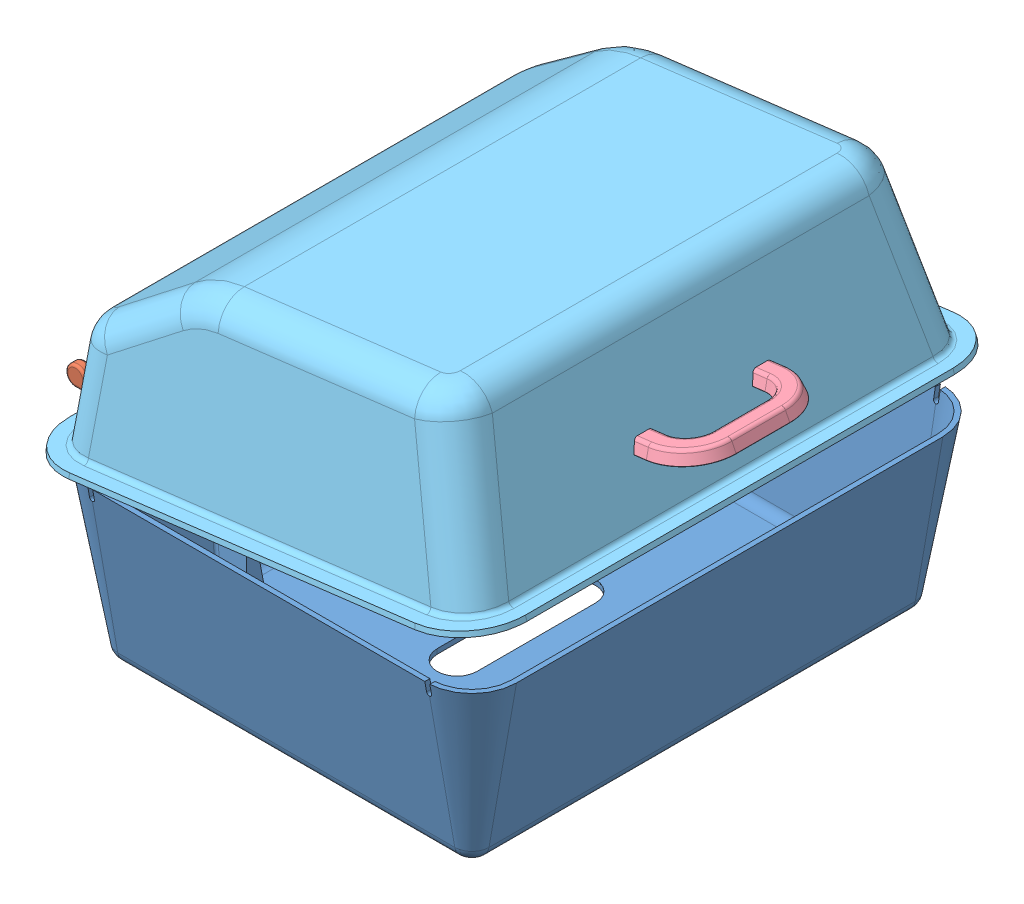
SolidWorks assembly Upper_&_Lower_Covers_&.SLDASM, configuration Default (file format 4400). Lengths in mm.
Overall size (690.56 509.01 691.95).
7 component instances, 5 part files, 15 mates.
Components (placement in the parent):
- lower_grill_&-1: lower_grill_&.SLDPRT [Default] at origin size (546.1 215.9 660.4)
- l_hinge_&-1: l_hinge_&.SLDPRT [Default] at (-273.05 0 -165.1) x (1 0 0) z (0 0 -1) size (102.13 88.85 50.98)
- l_hinge_&-2: l_hinge_&.SLDPRT [Default] at (-273.05 0 215.9) x (1 0 0) z (0 0 -1) size (102.13 88.85 50.98)
- hinge_female_&-1: hinge_female_&.sldprt [Default] at (-273.6223 9.3216 -190.5) x (0.992489 0.12233 0) z (0 0 1) size (102.13 88.85 50.98)
- hinge_female_&-2: hinge_female_&.sldprt [Default] at (-274.1093 -0.055 190.5) x (0.992489 0.12233 0) z (0 0 1) size (102.13 88.85 50.98)
- handle_front_mount_&-1: handle_front_mount_&.SLDPRT [Default] at (243.0331 149.7792 3.175) x (0.992489 0.12233 0) z (0 0 1) size (76.44 15.35 184.13)
- Upper_Cover_&-1: Upper_Cover_&.SLDPRT [Default] at (-2.6231 42.7239 3.175) x (0.992489 0.12233 0) z (0 0 1) size (590.35 215.9 691.95)
Mates (geometry in assembly coordinates):
- Concentric6: concentric aligned: cylinder of l_hinge_&-1 through (-349.25 0 -209.55) axis (0 0 1) radius 5.5563; cylinder of hinge_female_&-1 through (-349.25 0 -190.6816) axis (0 0 1) radius 6.35
- Coincident49: coincident anti-aligned: plane of l_hinge_&-1 through (-349.25 0 -177.8) normal (0 0 -1); plane of hinge_female_&-1 through (-349.25 0 -177.8) normal (0 0 1)
- Coincident47: coincident anti-aligned: plane of lower_grill_&-1 through (-273.05 0 -273.05) normal (-0.984808 -0.173648 0); plane of l_hinge_&-1 through (-259.818 -75.0424 -215.9) normal (0.984808 0.173648 0)
- Concentric2: concentric aligned: cylinder of lower_grill_&-1 through (268.1622 27.7267 -190.5) axis (-0.984808 -0.173648 0) radius 3.175; cylinder of l_hinge_&-1 through (-246.4672 -63.0163 -190.5) axis (-0.984808 -0.173648 0) radius 3.175
- Concentric3: concentric aligned: cylinder of lower_grill_&-1 through (262.6489 58.9944 -190.5) axis (-0.984808 -0.173648 0) radius 3.175; cylinder of l_hinge_&-1 through (-251.9805 -31.7487 -190.5) axis (-0.984808 -0.173648 0) radius 3.175
- Coincident481: coincident anti-aligned: plane of l_hinge_&-2 through (-259.818 -75.0424 165.1) normal (0.984808 0.173648 0); plane of lower_grill_&-1 through (-273.05 0 -273.05) normal (-0.984808 -0.173648 0)
- Concentric4: concentric aligned: cylinder of lower_grill_&-1 through (268.1622 27.7267 190.5) axis (-0.984808 -0.173648 0) radius 3.175; cylinder of l_hinge_&-2 through (-246.4672 -63.0163 190.5) axis (-0.984808 -0.173648 0) radius 3.175
- Concentric5: concentric aligned: cylinder of lower_grill_&-1 through (262.6489 58.9944 190.5) axis (-0.984808 -0.173648 0) radius 3.175; cylinder of l_hinge_&-2 through (-251.9805 -31.7487 190.5) axis (-0.984808 -0.173648 0) radius 3.175
- Concentric3: concentric aligned: cylinder of Upper_Cover_&-1 through (287.0315 15.1722 -165.1) axis (-0.998654 0.051872 0) radius 3.175; cylinder of hinge_female_&-1 through (-256.5949 43.4092 -165.1) axis (-0.998654 0.051872 0) radius 3.175
- Coincident2: coincident anti-aligned: plane of Upper_Cover_&-1 through (-273.6223 9.3216 327.025) normal (-0.998654 0.051872 0); plane of hinge_female_&-1 through (-269.6697 85.419 -139.7) normal (0.998654 -0.051872 0)
- Concentric4: concentric aligned: cylinder of Upper_Cover_&-1 through (288.6785 46.8795 -165.1) axis (-0.998654 0.051872 0) radius 3.175; cylinder of hinge_female_&-1 through (-254.948 75.1165 -165.1) axis (-0.998654 0.051872 0) radius 3.175
- Coincident3: coincident anti-aligned: plane of Upper_Cover_&-1 through (-273.6223 9.3216 327.025) normal (-0.998654 0.051872 0); plane of hinge_female_&-2 through (-270.1567 76.0424 241.3) normal (0.998654 -0.051872 0)
- Coincident1: coincident anti-aligned: plane of Upper_Cover_&-1 through (204.182 285.7477 327.025) normal (0.956169 0.292816 0); plane of handle_front_mount_&-1 through (245.5818 150.5597 3.175) normal (-0.956169 -0.292816 0)
- Concentric1: concentric aligned: cylinder of Upper_Cover_&-1 through (299.6932 176.3161 79.1522) axis (-0.956169 -0.292816 0) radius 1.3891; cylinder of handle_front_mount_&-1 through (243.01 158.9575 79.1522) axis (-0.956169 -0.292816 0) radius 1.3891
- Concentric2: concentric aligned: cylinder of Upper_Cover_&-1 through (299.6932 176.3161 -72.8022) axis (-0.956169 -0.292816 0) radius 1.3891; cylinder of handle_front_mount_&-1 through (243.01 158.9575 -72.8022) axis (-0.956169 -0.292816 0) radius 1.3891
